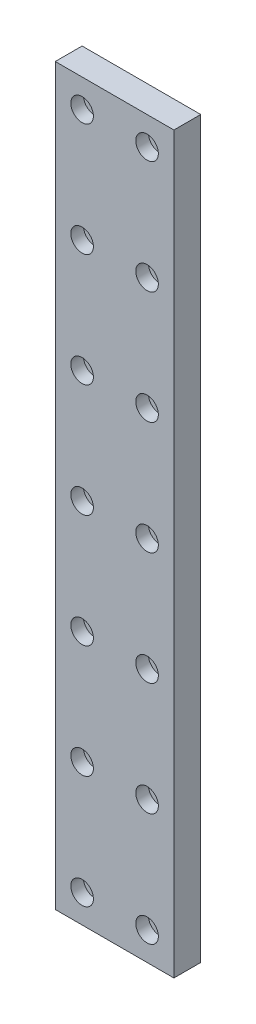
ISO-10303-21;
HEADER;
FILE_DESCRIPTION(('STEP AP214'),'2;1');
FILE_NAME('part.step','',(''),(''),'','','');
FILE_SCHEMA(('AUTOMOTIVE_DESIGN { 1 0 10303 214 1 1 1 1 }'));
ENDSEC;
DATA;
#1=APPLICATION_CONTEXT('core data for automotive mechanical design processes');
#2=APPLICATION_PROTOCOL_DEFINITION('international standard','automotive_design',2000,#1);
#3=PRODUCT_CONTEXT('',#1,'mechanical');
#4=PRODUCT('Part','Part','',(#3));
#5=PRODUCT_RELATED_PRODUCT_CATEGORY('part','',(#4));
#6=PRODUCT_DEFINITION_FORMATION('','',#4);
#7=PRODUCT_DEFINITION_CONTEXT('part definition',#1,'design');
#8=PRODUCT_DEFINITION('design','',#6,#7);
#9=PRODUCT_DEFINITION_SHAPE('','',#8);
#10=(LENGTH_UNIT() NAMED_UNIT(*) SI_UNIT(.MILLI.,.METRE.));
#11=(NAMED_UNIT(*) PLANE_ANGLE_UNIT() SI_UNIT($,.RADIAN.));
#12=(NAMED_UNIT(*) SI_UNIT($,.STERADIAN.) SOLID_ANGLE_UNIT());
#13=UNCERTAINTY_MEASURE_WITH_UNIT(LENGTH_MEASURE(1.E-05),#10,'distance_accuracy_value','');
#14=(GEOMETRIC_REPRESENTATION_CONTEXT(3) GLOBAL_UNCERTAINTY_ASSIGNED_CONTEXT((#13)) GLOBAL_UNIT_ASSIGNED_CONTEXT((#10,
#11,#12)) REPRESENTATION_CONTEXT('',''));
#15=CARTESIAN_POINT('',(0.,0.,0.));
#16=DIRECTION('',(0.,0.,1.));
#17=DIRECTION('',(1.,0.,0.));
#18=AXIS2_PLACEMENT_3D('',#15,#16,#17);
#19=CARTESIAN_POINT('',(-11.5,120.,0.));
#20=DIRECTION('',(0.,0.,1.));
#21=DIRECTION('',(1.,0.,0.));
#22=AXIS2_PLACEMENT_3D('',#19,#20,#21);
#23=CYLINDRICAL_SURFACE('',#22,2.25);
#24=CARTESIAN_POINT('',(-11.5,120.,0.));
#25=DIRECTION('',(0.,0.,1.));
#26=DIRECTION('',(1.,0.,0.));
#27=AXIS2_PLACEMENT_3D('',#24,#25,#26);
#28=CIRCLE('',#27,2.25);
#29=CARTESIAN_POINT('',(-9.25000000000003,120.,0.));
#30=VERTEX_POINT('',#29);
#31=EDGE_CURVE('E107',#30,#30,#28,.T.);
#32=ORIENTED_EDGE('',*,*,#31,.F.);
#33=EDGE_LOOP('',(#32));
#34=FACE_BOUND('',#33,.T.);
#35=CARTESIAN_POINT('',(-11.5,120.,5.));
#36=DIRECTION('',(0.,0.,1.));
#37=DIRECTION('',(1.,0.,0.));
#38=AXIS2_PLACEMENT_3D('',#35,#36,#37);
#39=CIRCLE('',#38,2.25);
#40=CARTESIAN_POINT('',(-9.25000000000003,120.,5.));
#41=VERTEX_POINT('',#40);
#42=EDGE_CURVE('E41',#41,#41,#39,.F.);
#43=ORIENTED_EDGE('',*,*,#42,.F.);
#44=EDGE_LOOP('',(#43));
#45=FACE_BOUND('',#44,.T.);
#46=ADVANCED_FACE('F37',(#34,#45),#23,.F.);
#47=CARTESIAN_POINT('',(-11.5000000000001,-120.,0.));
#48=DIRECTION('',(0.,0.,1.));
#49=DIRECTION('',(1.,0.,0.));
#50=AXIS2_PLACEMENT_3D('',#47,#48,#49);
#51=CYLINDRICAL_SURFACE('',#50,2.25);
#52=CARTESIAN_POINT('',(-11.5000000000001,-120.,0.));
#53=DIRECTION('',(0.,0.,1.));
#54=DIRECTION('',(1.,0.,0.));
#55=AXIS2_PLACEMENT_3D('',#52,#53,#54);
#56=CIRCLE('',#55,2.25);
#57=CARTESIAN_POINT('',(-9.25000000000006,-120.,0.));
#58=VERTEX_POINT('',#57);
#59=EDGE_CURVE('E158',#58,#58,#56,.T.);
#60=ORIENTED_EDGE('',*,*,#59,.F.);
#61=EDGE_LOOP('',(#60));
#62=FACE_BOUND('',#61,.T.);
#63=CARTESIAN_POINT('',(-11.5000000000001,-120.,5.));
#64=DIRECTION('',(0.,0.,1.));
#65=DIRECTION('',(1.,0.,0.));
#66=AXIS2_PLACEMENT_3D('',#63,#64,#65);
#67=CIRCLE('',#66,2.25);
#68=CARTESIAN_POINT('',(-9.25000000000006,-120.,5.));
#69=VERTEX_POINT('',#68);
#70=EDGE_CURVE('E149',#69,#69,#67,.F.);
#71=ORIENTED_EDGE('',*,*,#70,.F.);
#72=EDGE_LOOP('',(#71));
#73=FACE_BOUND('',#72,.T.);
#74=ADVANCED_FACE('F209',(#62,#73),#51,.F.);
#75=CARTESIAN_POINT('',(-11.5000000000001,-80.,0.));
#76=DIRECTION('',(0.,0.,1.));
#77=DIRECTION('',(1.,0.,0.));
#78=AXIS2_PLACEMENT_3D('',#75,#76,#77);
#79=CYLINDRICAL_SURFACE('',#78,2.25);
#80=CARTESIAN_POINT('',(-11.5000000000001,-80.,0.));
#81=DIRECTION('',(0.,0.,1.));
#82=DIRECTION('',(1.,0.,0.));
#83=AXIS2_PLACEMENT_3D('',#80,#81,#82);
#84=CIRCLE('',#83,2.25);
#85=CARTESIAN_POINT('',(-9.25000000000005,-80.,0.));
#86=VERTEX_POINT('',#85);
#87=EDGE_CURVE('E172',#86,#86,#84,.T.);
#88=ORIENTED_EDGE('',*,*,#87,.F.);
#89=EDGE_LOOP('',(#88));
#90=FACE_BOUND('',#89,.T.);
#91=CARTESIAN_POINT('',(-11.5000000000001,-80.,5.));
#92=DIRECTION('',(0.,0.,1.));
#93=DIRECTION('',(1.,0.,0.));
#94=AXIS2_PLACEMENT_3D('',#91,#92,#93);
#95=CIRCLE('',#94,2.25);
#96=CARTESIAN_POINT('',(-9.25000000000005,-80.,5.));
#97=VERTEX_POINT('',#96);
#98=EDGE_CURVE('E141',#97,#97,#95,.F.);
#99=ORIENTED_EDGE('',*,*,#98,.F.);
#100=EDGE_LOOP('',(#99));
#101=FACE_BOUND('',#100,.T.);
#102=ADVANCED_FACE('F214',(#90,#101),#79,.F.);
#103=CARTESIAN_POINT('',(-11.5000000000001,-40.,0.));
#104=DIRECTION('',(0.,0.,1.));
#105=DIRECTION('',(1.,0.,0.));
#106=AXIS2_PLACEMENT_3D('',#103,#104,#105);
#107=CYLINDRICAL_SURFACE('',#106,2.25);
#108=CARTESIAN_POINT('',(-11.5000000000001,-40.,0.));
#109=DIRECTION('',(0.,0.,1.));
#110=DIRECTION('',(1.,0.,0.));
#111=AXIS2_PLACEMENT_3D('',#108,#109,#110);
#112=CIRCLE('',#111,2.25);
#113=CARTESIAN_POINT('',(-9.25000000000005,-40.,0.));
#114=VERTEX_POINT('',#113);
#115=EDGE_CURVE('E196',#114,#114,#112,.T.);
#116=ORIENTED_EDGE('',*,*,#115,.F.);
#117=EDGE_LOOP('',(#116));
#118=FACE_BOUND('',#117,.T.);
#119=CARTESIAN_POINT('',(-11.5000000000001,-40.,5.));
#120=DIRECTION('',(0.,0.,1.));
#121=DIRECTION('',(1.,0.,0.));
#122=AXIS2_PLACEMENT_3D('',#119,#120,#121);
#123=CIRCLE('',#122,2.25);
#124=CARTESIAN_POINT('',(-9.25000000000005,-40.,5.));
#125=VERTEX_POINT('',#124);
#126=EDGE_CURVE('E132',#125,#125,#123,.F.);
#127=ORIENTED_EDGE('',*,*,#126,.F.);
#128=EDGE_LOOP('',(#127));
#129=FACE_BOUND('',#128,.T.);
#130=ADVANCED_FACE('F269',(#118,#129),#107,.F.);
#131=CARTESIAN_POINT('',(-11.5,0.,0.));
#132=DIRECTION('',(0.,0.,1.));
#133=DIRECTION('',(1.,0.,0.));
#134=AXIS2_PLACEMENT_3D('',#131,#132,#133);
#135=CYLINDRICAL_SURFACE('',#134,2.25);
#136=CARTESIAN_POINT('',(-11.5,0.,0.));
#137=DIRECTION('',(0.,0.,1.));
#138=DIRECTION('',(1.,0.,0.));
#139=AXIS2_PLACEMENT_3D('',#136,#137,#138);
#140=CIRCLE('',#139,2.25);
#141=CARTESIAN_POINT('',(-9.25000000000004,0.,0.));
#142=VERTEX_POINT('',#141);
#143=EDGE_CURVE('E190',#142,#142,#140,.T.);
#144=ORIENTED_EDGE('',*,*,#143,.F.);
#145=EDGE_LOOP('',(#144));
#146=FACE_BOUND('',#145,.T.);
#147=CARTESIAN_POINT('',(-11.5,0.,5.));
#148=DIRECTION('',(0.,0.,1.));
#149=DIRECTION('',(1.,0.,0.));
#150=AXIS2_PLACEMENT_3D('',#147,#148,#149);
#151=CIRCLE('',#150,2.25);
#152=CARTESIAN_POINT('',(-9.25000000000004,0.,5.));
#153=VERTEX_POINT('',#152);
#154=EDGE_CURVE('E126',#153,#153,#151,.F.);
#155=ORIENTED_EDGE('',*,*,#154,.F.);
#156=EDGE_LOOP('',(#155));
#157=FACE_BOUND('',#156,.T.);
#158=ADVANCED_FACE('F248',(#146,#157),#135,.F.);
#159=CARTESIAN_POINT('',(-11.5,40.,0.));
#160=DIRECTION('',(0.,0.,1.));
#161=DIRECTION('',(1.,0.,0.));
#162=AXIS2_PLACEMENT_3D('',#159,#160,#161);
#163=CYLINDRICAL_SURFACE('',#162,2.25);
#164=CARTESIAN_POINT('',(-11.5,40.,0.));
#165=DIRECTION('',(0.,0.,1.));
#166=DIRECTION('',(1.,0.,0.));
#167=AXIS2_PLACEMENT_3D('',#164,#165,#166);
#168=CIRCLE('',#167,2.25);
#169=CARTESIAN_POINT('',(-9.25000000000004,40.,0.));
#170=VERTEX_POINT('',#169);
#171=EDGE_CURVE('E184',#170,#170,#168,.T.);
#172=ORIENTED_EDGE('',*,*,#171,.F.);
#173=EDGE_LOOP('',(#172));
#174=FACE_BOUND('',#173,.T.);
#175=CARTESIAN_POINT('',(-11.5,40.,5.));
#176=DIRECTION('',(0.,0.,1.));
#177=DIRECTION('',(1.,0.,0.));
#178=AXIS2_PLACEMENT_3D('',#175,#176,#177);
#179=CIRCLE('',#178,2.25);
#180=CARTESIAN_POINT('',(-9.25000000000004,40.,5.));
#181=VERTEX_POINT('',#180);
#182=EDGE_CURVE('E120',#181,#181,#179,.F.);
#183=ORIENTED_EDGE('',*,*,#182,.F.);
#184=EDGE_LOOP('',(#183));
#185=FACE_BOUND('',#184,.T.);
#186=ADVANCED_FACE('F241',(#174,#185),#163,.F.);
#187=CARTESIAN_POINT('',(-11.5,80.,0.));
#188=DIRECTION('',(0.,0.,1.));
#189=DIRECTION('',(1.,0.,0.));
#190=AXIS2_PLACEMENT_3D('',#187,#188,#189);
#191=CYLINDRICAL_SURFACE('',#190,2.25);
#192=CARTESIAN_POINT('',(-11.5,80.,0.));
#193=DIRECTION('',(0.,0.,1.));
#194=DIRECTION('',(1.,0.,0.));
#195=AXIS2_PLACEMENT_3D('',#192,#193,#194);
#196=CIRCLE('',#195,2.25);
#197=CARTESIAN_POINT('',(-9.25000000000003,80.,0.));
#198=VERTEX_POINT('',#197);
#199=EDGE_CURVE('E178',#198,#198,#196,.T.);
#200=ORIENTED_EDGE('',*,*,#199,.F.);
#201=EDGE_LOOP('',(#200));
#202=FACE_BOUND('',#201,.T.);
#203=CARTESIAN_POINT('',(-11.5,80.,5.));
#204=DIRECTION('',(0.,0.,1.));
#205=DIRECTION('',(1.,0.,0.));
#206=AXIS2_PLACEMENT_3D('',#203,#204,#205);
#207=CIRCLE('',#206,2.25);
#208=CARTESIAN_POINT('',(-9.25000000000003,80.,5.));
#209=VERTEX_POINT('',#208);
#210=EDGE_CURVE('E113',#209,#209,#207,.F.);
#211=ORIENTED_EDGE('',*,*,#210,.F.);
#212=EDGE_LOOP('',(#211));
#213=FACE_BOUND('',#212,.T.);
#214=ADVANCED_FACE('F236',(#202,#213),#191,.F.);
#215=CARTESIAN_POINT('',(21.,130.,9.5));
#216=DIRECTION('',(-1.,0.,0.));
#217=DIRECTION('',(0.,-1.,0.));
#218=AXIS2_PLACEMENT_3D('',#215,#216,#217);
#219=PLANE('',#218);
#220=DIRECTION('',(0.,1.,0.));
#221=VECTOR('',#220,1.);
#222=CARTESIAN_POINT('',(21.,130.,0.));
#223=LINE('',#222,#221);
#224=CARTESIAN_POINT('',(21.,-130.,0.));
#225=VERTEX_POINT('',#224);
#226=CARTESIAN_POINT('',(21.,130.,0.));
#227=VERTEX_POINT('',#226);
#228=EDGE_CURVE('E104',#225,#227,#223,.T.);
#229=ORIENTED_EDGE('',*,*,#228,.T.);
#230=DIRECTION('',(0.,0.,-1.));
#231=VECTOR('',#230,1.);
#232=CARTESIAN_POINT('',(21.,130.,9.5));
#233=LINE('',#232,#231);
#234=CARTESIAN_POINT('',(21.,130.,9.5));
#235=VERTEX_POINT('',#234);
#236=EDGE_CURVE('E11',#235,#227,#233,.T.);
#237=ORIENTED_EDGE('',*,*,#236,.F.);
#238=DIRECTION('',(0.,1.,0.));
#239=VECTOR('',#238,1.);
#240=CARTESIAN_POINT('',(21.,130.,9.5));
#241=LINE('',#240,#239);
#242=CARTESIAN_POINT('',(21.,-130.,9.5));
#243=VERTEX_POINT('',#242);
#244=EDGE_CURVE('E91',#243,#235,#241,.T.);
#245=ORIENTED_EDGE('',*,*,#244,.F.);
#246=DIRECTION('',(0.,0.,-1.));
#247=VECTOR('',#246,1.);
#248=CARTESIAN_POINT('',(21.,-130.,9.5));
#249=LINE('',#248,#247);
#250=EDGE_CURVE('E100',#243,#225,#249,.T.);
#251=ORIENTED_EDGE('',*,*,#250,.T.);
#252=EDGE_LOOP('',(#229,#237,#245,#251));
#253=FACE_BOUND('',#252,.T.);
#254=ADVANCED_FACE('F39',(#253),#219,.F.);
#255=CARTESIAN_POINT('',(-21.,130.,9.5));
#256=DIRECTION('',(0.,-1.,0.));
#257=DIRECTION('',(0.,0.,-1.));
#258=AXIS2_PLACEMENT_3D('',#255,#256,#257);
#259=PLANE('',#258);
#260=DIRECTION('',(-1.,0.,0.));
#261=VECTOR('',#260,1.);
#262=CARTESIAN_POINT('',(-21.,130.,0.));
#263=LINE('',#262,#261);
#264=CARTESIAN_POINT('',(-21.,130.,0.));
#265=VERTEX_POINT('',#264);
#266=EDGE_CURVE('E95',#227,#265,#263,.T.);
#267=ORIENTED_EDGE('',*,*,#266,.T.);
#268=DIRECTION('',(0.,0.,-1.));
#269=VECTOR('',#268,1.);
#270=CARTESIAN_POINT('',(-21.,130.,9.5));
#271=LINE('',#270,#269);
#272=CARTESIAN_POINT('',(-21.,130.,9.5));
#273=VERTEX_POINT('',#272);
#274=EDGE_CURVE('E47',#273,#265,#271,.T.);
#275=ORIENTED_EDGE('',*,*,#274,.F.);
#276=DIRECTION('',(-1.,0.,0.));
#277=VECTOR('',#276,1.);
#278=CARTESIAN_POINT('',(-21.,130.,9.5));
#279=LINE('',#278,#277);
#280=EDGE_CURVE('E86',#235,#273,#279,.T.);
#281=ORIENTED_EDGE('',*,*,#280,.F.);
#282=ORIENTED_EDGE('',*,*,#236,.T.);
#283=EDGE_LOOP('',(#267,#275,#281,#282));
#284=FACE_BOUND('',#283,.T.);
#285=ADVANCED_FACE('F94',(#284),#259,.F.);
#286=CARTESIAN_POINT('',(-21.,130.,9.5));
#287=DIRECTION('',(1.,0.,0.));
#288=DIRECTION('',(0.,1.,0.));
#289=AXIS2_PLACEMENT_3D('',#286,#287,#288);
#290=PLANE('',#289);
#291=DIRECTION('',(0.,-1.,0.));
#292=VECTOR('',#291,1.);
#293=CARTESIAN_POINT('',(-21.,130.,0.));
#294=LINE('',#293,#292);
#295=CARTESIAN_POINT('',(-21.,-130.,0.));
#296=VERTEX_POINT('',#295);
#297=EDGE_CURVE('E73',#265,#296,#294,.T.);
#298=ORIENTED_EDGE('',*,*,#297,.T.);
#299=DIRECTION('',(0.,0.,-1.));
#300=VECTOR('',#299,1.);
#301=CARTESIAN_POINT('',(-21.,-130.,9.5));
#302=LINE('',#301,#300);
#303=CARTESIAN_POINT('',(-21.,-130.,9.5));
#304=VERTEX_POINT('',#303);
#305=EDGE_CURVE('E96',#304,#296,#302,.T.);
#306=ORIENTED_EDGE('',*,*,#305,.F.);
#307=DIRECTION('',(0.,-1.,0.));
#308=VECTOR('',#307,1.);
#309=CARTESIAN_POINT('',(-21.,130.,9.5));
#310=LINE('',#309,#308);
#311=EDGE_CURVE('E89',#273,#304,#310,.T.);
#312=ORIENTED_EDGE('',*,*,#311,.F.);
#313=ORIENTED_EDGE('',*,*,#274,.T.);
#314=EDGE_LOOP('',(#298,#306,#312,#313));
#315=FACE_BOUND('',#314,.T.);
#316=ADVANCED_FACE('F98',(#315),#290,.F.);
#317=CARTESIAN_POINT('',(-21.,-130.,9.5));
#318=DIRECTION('',(0.,1.,0.));
#319=DIRECTION('',(0.,0.,1.));
#320=AXIS2_PLACEMENT_3D('',#317,#318,#319);
#321=PLANE('',#320);
#322=DIRECTION('',(1.,0.,0.));
#323=VECTOR('',#322,1.);
#324=CARTESIAN_POINT('',(-21.,-130.,0.));
#325=LINE('',#324,#323);
#326=EDGE_CURVE('E79',#296,#225,#325,.T.);
#327=ORIENTED_EDGE('',*,*,#326,.T.);
#328=ORIENTED_EDGE('',*,*,#250,.F.);
#329=DIRECTION('',(1.,0.,0.));
#330=VECTOR('',#329,1.);
#331=CARTESIAN_POINT('',(-21.,-130.,9.5));
#332=LINE('',#331,#330);
#333=EDGE_CURVE('E56',#304,#243,#332,.T.);
#334=ORIENTED_EDGE('',*,*,#333,.F.);
#335=ORIENTED_EDGE('',*,*,#305,.T.);
#336=EDGE_LOOP('',(#327,#328,#334,#335));
#337=FACE_BOUND('',#336,.T.);
#338=ADVANCED_FACE('F223',(#337),#321,.F.);
#339=CARTESIAN_POINT('',(0.,0.,9.5));
#340=DIRECTION('',(0.,0.,1.));
#341=DIRECTION('',(1.,0.,0.));
#342=AXIS2_PLACEMENT_3D('',#339,#340,#341);
#343=PLANE('',#342);
#344=CARTESIAN_POINT('',(11.5,40.,9.5));
#345=DIRECTION('',(0.,0.,1.));
#346=DIRECTION('',(-1.,0.,0.));
#347=AXIS2_PLACEMENT_3D('',#344,#345,#346);
#348=CIRCLE('',#347,4.);
#349=CARTESIAN_POINT('',(7.50000000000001,40.,9.5));
#350=VERTEX_POINT('',#349);
#351=EDGE_CURVE('E857',#350,#350,#348,.T.);
#352=ORIENTED_EDGE('',*,*,#351,.F.);
#353=EDGE_LOOP('',(#352));
#354=FACE_BOUND('',#353,.T.);
#355=CARTESIAN_POINT('',(-11.5,0.,9.5));
#356=DIRECTION('',(0.,0.,1.));
#357=DIRECTION('',(1.,0.,0.));
#358=AXIS2_PLACEMENT_3D('',#355,#356,#357);
#359=CIRCLE('',#358,4.);
#360=CARTESIAN_POINT('',(-7.50000000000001,0.,9.5));
#361=VERTEX_POINT('',#360);
#362=EDGE_CURVE('E864',#361,#361,#359,.T.);
#363=ORIENTED_EDGE('',*,*,#362,.F.);
#364=EDGE_LOOP('',(#363));
#365=FACE_BOUND('',#364,.T.);
#366=CARTESIAN_POINT('',(11.5,0.,9.5));
#367=DIRECTION('',(0.,0.,1.));
#368=DIRECTION('',(-1.,0.,0.));
#369=AXIS2_PLACEMENT_3D('',#366,#367,#368);
#370=CIRCLE('',#369,4.);
#371=CARTESIAN_POINT('',(7.50000000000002,0.,9.5));
#372=VERTEX_POINT('',#371);
#373=EDGE_CURVE('E848',#372,#372,#370,.T.);
#374=ORIENTED_EDGE('',*,*,#373,.F.);
#375=EDGE_LOOP('',(#374));
#376=FACE_BOUND('',#375,.T.);
#377=CARTESIAN_POINT('',(-11.5,-40.,9.5));
#378=DIRECTION('',(0.,0.,1.));
#379=DIRECTION('',(1.,0.,0.));
#380=AXIS2_PLACEMENT_3D('',#377,#378,#379);
#381=CIRCLE('',#380,4.);
#382=CARTESIAN_POINT('',(-7.50000000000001,-40.,9.5));
#383=VERTEX_POINT('',#382);
#384=EDGE_CURVE('E853',#383,#383,#381,.T.);
#385=ORIENTED_EDGE('',*,*,#384,.F.);
#386=EDGE_LOOP('',(#385));
#387=FACE_BOUND('',#386,.T.);
#388=CARTESIAN_POINT('',(11.5,120.,9.5));
#389=DIRECTION('',(0.,0.,1.));
#390=DIRECTION('',(-1.,0.,0.));
#391=AXIS2_PLACEMENT_3D('',#388,#389,#390);
#392=CIRCLE('',#391,4.);
#393=CARTESIAN_POINT('',(7.5,120.,9.5));
#394=VERTEX_POINT('',#393);
#395=EDGE_CURVE('E881',#394,#394,#392,.T.);
#396=ORIENTED_EDGE('',*,*,#395,.F.);
#397=EDGE_LOOP('',(#396));
#398=FACE_BOUND('',#397,.T.);
#399=CARTESIAN_POINT('',(-11.5,80.,9.5));
#400=DIRECTION('',(0.,0.,1.));
#401=DIRECTION('',(1.,0.,0.));
#402=AXIS2_PLACEMENT_3D('',#399,#400,#401);
#403=CIRCLE('',#402,4.);
#404=CARTESIAN_POINT('',(-7.50000000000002,80.,9.5));
#405=VERTEX_POINT('',#404);
#406=EDGE_CURVE('E887',#405,#405,#403,.T.);
#407=ORIENTED_EDGE('',*,*,#406,.F.);
#408=EDGE_LOOP('',(#407));
#409=FACE_BOUND('',#408,.T.);
#410=CARTESIAN_POINT('',(11.5,80.,9.5));
#411=DIRECTION('',(0.,0.,1.));
#412=DIRECTION('',(-1.,0.,0.));
#413=AXIS2_PLACEMENT_3D('',#410,#411,#412);
#414=CIRCLE('',#413,4.);
#415=CARTESIAN_POINT('',(7.50000000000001,80.,9.5));
#416=VERTEX_POINT('',#415);
#417=EDGE_CURVE('E869',#416,#416,#414,.T.);
#418=ORIENTED_EDGE('',*,*,#417,.F.);
#419=EDGE_LOOP('',(#418));
#420=FACE_BOUND('',#419,.T.);
#421=CARTESIAN_POINT('',(-11.5,40.,9.5));
#422=DIRECTION('',(0.,0.,1.));
#423=DIRECTION('',(1.,0.,0.));
#424=AXIS2_PLACEMENT_3D('',#421,#422,#423);
#425=CIRCLE('',#424,4.);
#426=CARTESIAN_POINT('',(-7.50000000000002,40.,9.5));
#427=VERTEX_POINT('',#426);
#428=EDGE_CURVE('E876',#427,#427,#425,.T.);
#429=ORIENTED_EDGE('',*,*,#428,.F.);
#430=EDGE_LOOP('',(#429));
#431=FACE_BOUND('',#430,.T.);
#432=CARTESIAN_POINT('',(11.5,-120.,9.5));
#433=DIRECTION('',(0.,0.,1.));
#434=DIRECTION('',(-1.,0.,0.));
#435=AXIS2_PLACEMENT_3D('',#432,#433,#434);
#436=CIRCLE('',#435,4.);
#437=CARTESIAN_POINT('',(7.50000000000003,-120.,9.5));
#438=VERTEX_POINT('',#437);
#439=EDGE_CURVE('E819',#438,#438,#436,.T.);
#440=ORIENTED_EDGE('',*,*,#439,.F.);
#441=EDGE_LOOP('',(#440));
#442=FACE_BOUND('',#441,.T.);
#443=CARTESIAN_POINT('',(11.5,-40.,9.5));
#444=DIRECTION('',(0.,0.,1.));
#445=DIRECTION('',(-1.,0.,0.));
#446=AXIS2_PLACEMENT_3D('',#443,#444,#445);
#447=CIRCLE('',#446,4.);
#448=CARTESIAN_POINT('',(7.50000000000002,-40.,9.5));
#449=VERTEX_POINT('',#448);
#450=EDGE_CURVE('E836',#449,#449,#447,.T.);
#451=ORIENTED_EDGE('',*,*,#450,.F.);
#452=EDGE_LOOP('',(#451));
#453=FACE_BOUND('',#452,.T.);
#454=CARTESIAN_POINT('',(-11.5,-80.,9.5));
#455=DIRECTION('',(0.,0.,1.));
#456=DIRECTION('',(1.,0.,0.));
#457=AXIS2_PLACEMENT_3D('',#454,#455,#456);
#458=CIRCLE('',#457,4.);
#459=CARTESIAN_POINT('',(-7.5,-80.,9.5));
#460=VERTEX_POINT('',#459);
#461=EDGE_CURVE('E843',#460,#460,#458,.T.);
#462=ORIENTED_EDGE('',*,*,#461,.F.);
#463=EDGE_LOOP('',(#462));
#464=FACE_BOUND('',#463,.T.);
#465=CARTESIAN_POINT('',(11.5,-80.,9.5));
#466=DIRECTION('',(0.,0.,1.));
#467=DIRECTION('',(-1.,0.,0.));
#468=AXIS2_PLACEMENT_3D('',#465,#466,#467);
#469=CIRCLE('',#468,4.);
#470=CARTESIAN_POINT('',(7.50000000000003,-80.,9.5));
#471=VERTEX_POINT('',#470);
#472=EDGE_CURVE('E828',#471,#471,#469,.T.);
#473=ORIENTED_EDGE('',*,*,#472,.F.);
#474=EDGE_LOOP('',(#473));
#475=FACE_BOUND('',#474,.T.);
#476=CARTESIAN_POINT('',(-11.5,-120.,9.5));
#477=DIRECTION('',(0.,0.,1.));
#478=DIRECTION('',(1.,0.,0.));
#479=AXIS2_PLACEMENT_3D('',#476,#477,#478);
#480=CIRCLE('',#479,4.);
#481=CARTESIAN_POINT('',(-7.5,-120.,9.5));
#482=VERTEX_POINT('',#481);
#483=EDGE_CURVE('E824',#482,#482,#480,.T.);
#484=ORIENTED_EDGE('',*,*,#483,.F.);
#485=EDGE_LOOP('',(#484));
#486=FACE_BOUND('',#485,.T.);
#487=CARTESIAN_POINT('',(-11.5,120.,9.5));
#488=DIRECTION('',(0.,0.,1.));
#489=DIRECTION('',(1.,0.,0.));
#490=AXIS2_PLACEMENT_3D('',#487,#488,#489);
#491=CIRCLE('',#490,4.);
#492=CARTESIAN_POINT('',(-7.50000000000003,120.,9.5));
#493=VERTEX_POINT('',#492);
#494=EDGE_CURVE('E167',#493,#493,#491,.T.);
#495=ORIENTED_EDGE('',*,*,#494,.F.);
#496=EDGE_LOOP('',(#495));
#497=FACE_BOUND('',#496,.T.);
#498=ORIENTED_EDGE('',*,*,#244,.T.);
#499=ORIENTED_EDGE('',*,*,#280,.T.);
#500=ORIENTED_EDGE('',*,*,#311,.T.);
#501=ORIENTED_EDGE('',*,*,#333,.T.);
#502=EDGE_LOOP('',(#498,#499,#500,#501));
#503=FACE_BOUND('',#502,.T.);
#504=ADVANCED_FACE('F87',(#354,#365,#376,#387,#398,#409,#420,#431,#442,#453,#464,#475,#486,#497,
#503),#343,.T.);
#505=CARTESIAN_POINT('',(0.,0.,0.));
#506=DIRECTION('',(0.,0.,1.));
#507=DIRECTION('',(1.,0.,0.));
#508=AXIS2_PLACEMENT_3D('',#505,#506,#507);
#509=PLANE('',#508);
#510=ORIENTED_EDGE('',*,*,#199,.T.);
#511=EDGE_LOOP('',(#510));
#512=FACE_BOUND('',#511,.T.);
#513=CARTESIAN_POINT('',(11.5,80.,0.));
#514=DIRECTION('',(0.,0.,1.));
#515=DIRECTION('',(-1.,0.,0.));
#516=AXIS2_PLACEMENT_3D('',#513,#514,#515);
#517=CIRCLE('',#516,2.25);
#518=CARTESIAN_POINT('',(9.25,80.,0.));
#519=VERTEX_POINT('',#518);
#520=EDGE_CURVE('E181',#519,#519,#517,.T.);
#521=ORIENTED_EDGE('',*,*,#520,.T.);
#522=EDGE_LOOP('',(#521));
#523=FACE_BOUND('',#522,.T.);
#524=ORIENTED_EDGE('',*,*,#171,.T.);
#525=EDGE_LOOP('',(#524));
#526=FACE_BOUND('',#525,.T.);
#527=CARTESIAN_POINT('',(11.5,40.,0.));
#528=DIRECTION('',(0.,0.,1.));
#529=DIRECTION('',(-1.,0.,0.));
#530=AXIS2_PLACEMENT_3D('',#527,#528,#529);
#531=CIRCLE('',#530,2.25);
#532=CARTESIAN_POINT('',(9.24999999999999,40.,0.));
#533=VERTEX_POINT('',#532);
#534=EDGE_CURVE('E187',#533,#533,#531,.T.);
#535=ORIENTED_EDGE('',*,*,#534,.T.);
#536=EDGE_LOOP('',(#535));
#537=FACE_BOUND('',#536,.T.);
#538=ORIENTED_EDGE('',*,*,#143,.T.);
#539=EDGE_LOOP('',(#538));
#540=FACE_BOUND('',#539,.T.);
#541=CARTESIAN_POINT('',(11.5,0.,0.));
#542=DIRECTION('',(0.,0.,1.));
#543=DIRECTION('',(-1.,0.,0.));
#544=AXIS2_PLACEMENT_3D('',#541,#542,#543);
#545=CIRCLE('',#544,2.25);
#546=CARTESIAN_POINT('',(9.24999999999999,0.,0.));
#547=VERTEX_POINT('',#546);
#548=EDGE_CURVE('E193',#547,#547,#545,.T.);
#549=ORIENTED_EDGE('',*,*,#548,.T.);
#550=EDGE_LOOP('',(#549));
#551=FACE_BOUND('',#550,.T.);
#552=ORIENTED_EDGE('',*,*,#115,.T.);
#553=EDGE_LOOP('',(#552));
#554=FACE_BOUND('',#553,.T.);
#555=CARTESIAN_POINT('',(11.5,-40.,0.));
#556=DIRECTION('',(0.,0.,1.));
#557=DIRECTION('',(-1.,0.,0.));
#558=AXIS2_PLACEMENT_3D('',#555,#556,#557);
#559=CIRCLE('',#558,2.25);
#560=CARTESIAN_POINT('',(9.24999999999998,-40.,0.));
#561=VERTEX_POINT('',#560);
#562=EDGE_CURVE('E175',#561,#561,#559,.T.);
#563=ORIENTED_EDGE('',*,*,#562,.T.);
#564=EDGE_LOOP('',(#563));
#565=FACE_BOUND('',#564,.T.);
#566=CARTESIAN_POINT('',(11.5,-120.,0.));
#567=DIRECTION('',(0.,0.,1.));
#568=DIRECTION('',(-1.,0.,0.));
#569=AXIS2_PLACEMENT_3D('',#566,#567,#568);
#570=CIRCLE('',#569,2.25);
#571=CARTESIAN_POINT('',(9.24999999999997,-120.,0.));
#572=VERTEX_POINT('',#571);
#573=EDGE_CURVE('E154',#572,#572,#570,.T.);
#574=ORIENTED_EDGE('',*,*,#573,.T.);
#575=EDGE_LOOP('',(#574));
#576=FACE_BOUND('',#575,.T.);
#577=ORIENTED_EDGE('',*,*,#87,.T.);
#578=EDGE_LOOP('',(#577));
#579=FACE_BOUND('',#578,.T.);
#580=CARTESIAN_POINT('',(11.5,-80.,0.));
#581=DIRECTION('',(0.,0.,1.));
#582=DIRECTION('',(-1.,0.,0.));
#583=AXIS2_PLACEMENT_3D('',#580,#581,#582);
#584=CIRCLE('',#583,2.25);
#585=CARTESIAN_POINT('',(9.24999999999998,-80.,0.));
#586=VERTEX_POINT('',#585);
#587=EDGE_CURVE('E170',#586,#586,#584,.T.);
#588=ORIENTED_EDGE('',*,*,#587,.T.);
#589=EDGE_LOOP('',(#588));
#590=FACE_BOUND('',#589,.T.);
#591=CARTESIAN_POINT('',(11.5,120.,0.));
#592=DIRECTION('',(0.,0.,1.));
#593=DIRECTION('',(-1.,0.,0.));
#594=AXIS2_PLACEMENT_3D('',#591,#592,#593);
#595=CIRCLE('',#594,2.25);
#596=CARTESIAN_POINT('',(9.25000000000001,120.,0.));
#597=VERTEX_POINT('',#596);
#598=EDGE_CURVE('E163',#597,#597,#595,.T.);
#599=ORIENTED_EDGE('',*,*,#598,.T.);
#600=EDGE_LOOP('',(#599));
#601=FACE_BOUND('',#600,.T.);
#602=ORIENTED_EDGE('',*,*,#59,.T.);
#603=EDGE_LOOP('',(#602));
#604=FACE_BOUND('',#603,.T.);
#605=ORIENTED_EDGE('',*,*,#31,.T.);
#606=EDGE_LOOP('',(#605));
#607=FACE_BOUND('',#606,.T.);
#608=ORIENTED_EDGE('',*,*,#228,.F.);
#609=ORIENTED_EDGE('',*,*,#326,.F.);
#610=ORIENTED_EDGE('',*,*,#297,.F.);
#611=ORIENTED_EDGE('',*,*,#266,.F.);
#612=EDGE_LOOP('',(#608,#609,#610,#611));
#613=FACE_BOUND('',#612,.T.);
#614=ADVANCED_FACE('F204',(#512,#523,#526,#537,#540,#551,#554,#565,#576,#579,#590,#601,#604,
#607,#613),#509,.F.);
#615=CARTESIAN_POINT('',(11.5,120.,0.));
#616=DIRECTION('',(0.,0.,1.));
#617=DIRECTION('',(1.,0.,0.));
#618=AXIS2_PLACEMENT_3D('',#615,#616,#617);
#619=CYLINDRICAL_SURFACE('',#618,2.25);
#620=CARTESIAN_POINT('',(11.5,120.,5.));
#621=DIRECTION('',(0.,0.,-1.));
#622=DIRECTION('',(-1.,0.,0.));
#623=AXIS2_PLACEMENT_3D('',#620,#621,#622);
#624=CIRCLE('',#623,2.25);
#625=CARTESIAN_POINT('',(9.25000000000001,120.,5.));
#626=VERTEX_POINT('',#625);
#627=EDGE_CURVE('E147',#626,#626,#624,.F.);
#628=ORIENTED_EDGE('',*,*,#627,.T.);
#629=EDGE_LOOP('',(#628));
#630=FACE_BOUND('',#629,.T.);
#631=ORIENTED_EDGE('',*,*,#598,.F.);
#632=EDGE_LOOP('',(#631));
#633=FACE_BOUND('',#632,.T.);
#634=ADVANCED_FACE('F227',(#630,#633),#619,.F.);
#635=CARTESIAN_POINT('',(11.5,-80.,0.));
#636=DIRECTION('',(0.,0.,1.));
#637=DIRECTION('',(1.,0.,0.));
#638=AXIS2_PLACEMENT_3D('',#635,#636,#637);
#639=CYLINDRICAL_SURFACE('',#638,2.25);
#640=CARTESIAN_POINT('',(11.5,-80.,5.));
#641=DIRECTION('',(0.,0.,-1.));
#642=DIRECTION('',(-1.,0.,0.));
#643=AXIS2_PLACEMENT_3D('',#640,#641,#642);
#644=CIRCLE('',#643,2.25);
#645=CARTESIAN_POINT('',(9.24999999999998,-80.,5.));
#646=VERTEX_POINT('',#645);
#647=EDGE_CURVE('E144',#646,#646,#644,.F.);
#648=ORIENTED_EDGE('',*,*,#647,.T.);
#649=EDGE_LOOP('',(#648));
#650=FACE_BOUND('',#649,.T.);
#651=ORIENTED_EDGE('',*,*,#587,.F.);
#652=EDGE_LOOP('',(#651));
#653=FACE_BOUND('',#652,.T.);
#654=ADVANCED_FACE('F255',(#650,#653),#639,.F.);
#655=CARTESIAN_POINT('',(11.5,-120.,0.));
#656=DIRECTION('',(0.,0.,1.));
#657=DIRECTION('',(1.,0.,0.));
#658=AXIS2_PLACEMENT_3D('',#655,#656,#657);
#659=CYLINDRICAL_SURFACE('',#658,2.25);
#660=CARTESIAN_POINT('',(11.5,-120.,5.));
#661=DIRECTION('',(0.,0.,-1.));
#662=DIRECTION('',(-1.,0.,0.));
#663=AXIS2_PLACEMENT_3D('',#660,#661,#662);
#664=CIRCLE('',#663,2.25);
#665=CARTESIAN_POINT('',(9.24999999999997,-120.,5.));
#666=VERTEX_POINT('',#665);
#667=EDGE_CURVE('E138',#666,#666,#664,.F.);
#668=ORIENTED_EDGE('',*,*,#667,.T.);
#669=EDGE_LOOP('',(#668));
#670=FACE_BOUND('',#669,.T.);
#671=ORIENTED_EDGE('',*,*,#573,.F.);
#672=EDGE_LOOP('',(#671));
#673=FACE_BOUND('',#672,.T.);
#674=ADVANCED_FACE('F360',(#670,#673),#659,.F.);
#675=CARTESIAN_POINT('',(11.5,-40.,0.));
#676=DIRECTION('',(0.,0.,1.));
#677=DIRECTION('',(1.,0.,0.));
#678=AXIS2_PLACEMENT_3D('',#675,#676,#677);
#679=CYLINDRICAL_SURFACE('',#678,2.25);
#680=CARTESIAN_POINT('',(11.5,-40.,5.));
#681=DIRECTION('',(0.,0.,-1.));
#682=DIRECTION('',(-1.,0.,0.));
#683=AXIS2_PLACEMENT_3D('',#680,#681,#682);
#684=CIRCLE('',#683,2.25);
#685=CARTESIAN_POINT('',(9.24999999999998,-40.,5.));
#686=VERTEX_POINT('',#685);
#687=EDGE_CURVE('E135',#686,#686,#684,.F.);
#688=ORIENTED_EDGE('',*,*,#687,.T.);
#689=EDGE_LOOP('',(#688));
#690=FACE_BOUND('',#689,.T.);
#691=ORIENTED_EDGE('',*,*,#562,.F.);
#692=EDGE_LOOP('',(#691));
#693=FACE_BOUND('',#692,.T.);
#694=ADVANCED_FACE('F219',(#690,#693),#679,.F.);
#695=CARTESIAN_POINT('',(11.5,0.,0.));
#696=DIRECTION('',(0.,0.,1.));
#697=DIRECTION('',(1.,0.,0.));
#698=AXIS2_PLACEMENT_3D('',#695,#696,#697);
#699=CYLINDRICAL_SURFACE('',#698,2.25);
#700=CARTESIAN_POINT('',(11.5,0.,5.));
#701=DIRECTION('',(0.,0.,-1.));
#702=DIRECTION('',(-1.,0.,0.));
#703=AXIS2_PLACEMENT_3D('',#700,#701,#702);
#704=CIRCLE('',#703,2.25);
#705=CARTESIAN_POINT('',(9.24999999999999,0.,5.));
#706=VERTEX_POINT('',#705);
#707=EDGE_CURVE('E129',#706,#706,#704,.F.);
#708=ORIENTED_EDGE('',*,*,#707,.T.);
#709=EDGE_LOOP('',(#708));
#710=FACE_BOUND('',#709,.T.);
#711=ORIENTED_EDGE('',*,*,#548,.F.);
#712=EDGE_LOOP('',(#711));
#713=FACE_BOUND('',#712,.T.);
#714=ADVANCED_FACE('F265',(#710,#713),#699,.F.);
#715=CARTESIAN_POINT('',(11.5,40.,0.));
#716=DIRECTION('',(0.,0.,1.));
#717=DIRECTION('',(1.,0.,0.));
#718=AXIS2_PLACEMENT_3D('',#715,#716,#717);
#719=CYLINDRICAL_SURFACE('',#718,2.25);
#720=CARTESIAN_POINT('',(11.5,40.,5.));
#721=DIRECTION('',(0.,0.,-1.));
#722=DIRECTION('',(-1.,0.,0.));
#723=AXIS2_PLACEMENT_3D('',#720,#721,#722);
#724=CIRCLE('',#723,2.25);
#725=CARTESIAN_POINT('',(9.24999999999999,40.,5.));
#726=VERTEX_POINT('',#725);
#727=EDGE_CURVE('E123',#726,#726,#724,.F.);
#728=ORIENTED_EDGE('',*,*,#727,.T.);
#729=EDGE_LOOP('',(#728));
#730=FACE_BOUND('',#729,.T.);
#731=ORIENTED_EDGE('',*,*,#534,.F.);
#732=EDGE_LOOP('',(#731));
#733=FACE_BOUND('',#732,.T.);
#734=ADVANCED_FACE('F260',(#730,#733),#719,.F.);
#735=CARTESIAN_POINT('',(11.5,80.,0.));
#736=DIRECTION('',(0.,0.,1.));
#737=DIRECTION('',(1.,0.,0.));
#738=AXIS2_PLACEMENT_3D('',#735,#736,#737);
#739=CYLINDRICAL_SURFACE('',#738,2.25);
#740=CARTESIAN_POINT('',(11.5,80.,5.));
#741=DIRECTION('',(0.,0.,-1.));
#742=DIRECTION('',(-1.,0.,0.));
#743=AXIS2_PLACEMENT_3D('',#740,#741,#742);
#744=CIRCLE('',#743,2.25);
#745=CARTESIAN_POINT('',(9.25,80.,5.));
#746=VERTEX_POINT('',#745);
#747=EDGE_CURVE('E116',#746,#746,#744,.F.);
#748=ORIENTED_EDGE('',*,*,#747,.T.);
#749=EDGE_LOOP('',(#748));
#750=FACE_BOUND('',#749,.T.);
#751=ORIENTED_EDGE('',*,*,#520,.F.);
#752=EDGE_LOOP('',(#751));
#753=FACE_BOUND('',#752,.T.);
#754=ADVANCED_FACE('F257',(#750,#753),#739,.F.);
#755=CARTESIAN_POINT('',(-11.5,80.,5.));
#756=DIRECTION('',(0.,0.,1.));
#757=DIRECTION('',(1.,0.,0.));
#758=AXIS2_PLACEMENT_3D('',#755,#756,#757);
#759=PLANE('',#758);
#760=CARTESIAN_POINT('',(-11.5,80.,5.));
#761=DIRECTION('',(0.,0.,1.));
#762=DIRECTION('',(1.,0.,0.));
#763=AXIS2_PLACEMENT_3D('',#760,#761,#762);
#764=CIRCLE('',#763,4.);
#765=CARTESIAN_POINT('',(-7.50000000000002,80.,5.));
#766=VERTEX_POINT('',#765);
#767=EDGE_CURVE('E872',#766,#766,#764,.T.);
#768=ORIENTED_EDGE('',*,*,#767,.T.);
#769=EDGE_LOOP('',(#768));
#770=FACE_BOUND('',#769,.T.);
#771=ORIENTED_EDGE('',*,*,#210,.T.);
#772=EDGE_LOOP('',(#771));
#773=FACE_BOUND('',#772,.T.);
#774=ADVANCED_FACE('F259',(#770,#773),#759,.T.);
#775=CARTESIAN_POINT('',(-11.5,80.,5.));
#776=DIRECTION('',(0.,0.,1.));
#777=DIRECTION('',(1.,0.,0.));
#778=AXIS2_PLACEMENT_3D('',#775,#776,#777);
#779=CYLINDRICAL_SURFACE('',#778,4.);
#780=ORIENTED_EDGE('',*,*,#767,.F.);
#781=EDGE_LOOP('',(#780));
#782=FACE_BOUND('',#781,.T.);
#783=ORIENTED_EDGE('',*,*,#406,.T.);
#784=EDGE_LOOP('',(#783));
#785=FACE_BOUND('',#784,.T.);
#786=ADVANCED_FACE('F327',(#782,#785),#779,.F.);
#787=CARTESIAN_POINT('',(11.5,80.,5.));
#788=DIRECTION('',(0.,0.,-1.));
#789=DIRECTION('',(-1.,0.,0.));
#790=AXIS2_PLACEMENT_3D('',#787,#788,#789);
#791=PLANE('',#790);
#792=CARTESIAN_POINT('',(11.5,80.,5.));
#793=DIRECTION('',(0.,0.,1.));
#794=DIRECTION('',(-1.,0.,0.));
#795=AXIS2_PLACEMENT_3D('',#792,#793,#794);
#796=CIRCLE('',#795,4.);
#797=CARTESIAN_POINT('',(7.50000000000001,80.,5.));
#798=VERTEX_POINT('',#797);
#799=EDGE_CURVE('E873',#798,#798,#796,.T.);
#800=ORIENTED_EDGE('',*,*,#799,.T.);
#801=EDGE_LOOP('',(#800));
#802=FACE_BOUND('',#801,.T.);
#803=ORIENTED_EDGE('',*,*,#747,.F.);
#804=EDGE_LOOP('',(#803));
#805=FACE_BOUND('',#804,.T.);
#806=ADVANCED_FACE('F323',(#802,#805),#791,.F.);
#807=CARTESIAN_POINT('',(11.5,80.,5.));
#808=DIRECTION('',(0.,0.,1.));
#809=DIRECTION('',(1.,0.,0.));
#810=AXIS2_PLACEMENT_3D('',#807,#808,#809);
#811=CYLINDRICAL_SURFACE('',#810,4.);
#812=ORIENTED_EDGE('',*,*,#799,.F.);
#813=EDGE_LOOP('',(#812));
#814=FACE_BOUND('',#813,.T.);
#815=ORIENTED_EDGE('',*,*,#417,.T.);
#816=EDGE_LOOP('',(#815));
#817=FACE_BOUND('',#816,.T.);
#818=ADVANCED_FACE('F319',(#814,#817),#811,.F.);
#819=CARTESIAN_POINT('',(-11.5,40.,5.));
#820=DIRECTION('',(0.,0.,1.));
#821=DIRECTION('',(1.,0.,0.));
#822=AXIS2_PLACEMENT_3D('',#819,#820,#821);
#823=PLANE('',#822);
#824=CARTESIAN_POINT('',(-11.5,40.,5.));
#825=DIRECTION('',(0.,0.,1.));
#826=DIRECTION('',(1.,0.,0.));
#827=AXIS2_PLACEMENT_3D('',#824,#825,#826);
#828=CIRCLE('',#827,4.);
#829=CARTESIAN_POINT('',(-7.50000000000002,40.,5.));
#830=VERTEX_POINT('',#829);
#831=EDGE_CURVE('E860',#830,#830,#828,.T.);
#832=ORIENTED_EDGE('',*,*,#831,.T.);
#833=EDGE_LOOP('',(#832));
#834=FACE_BOUND('',#833,.T.);
#835=ORIENTED_EDGE('',*,*,#182,.T.);
#836=EDGE_LOOP('',(#835));
#837=FACE_BOUND('',#836,.T.);
#838=ADVANCED_FACE('F322',(#834,#837),#823,.T.);
#839=CARTESIAN_POINT('',(-11.5,40.,5.));
#840=DIRECTION('',(0.,0.,1.));
#841=DIRECTION('',(1.,0.,0.));
#842=AXIS2_PLACEMENT_3D('',#839,#840,#841);
#843=CYLINDRICAL_SURFACE('',#842,4.);
#844=ORIENTED_EDGE('',*,*,#831,.F.);
#845=EDGE_LOOP('',(#844));
#846=FACE_BOUND('',#845,.T.);
#847=ORIENTED_EDGE('',*,*,#428,.T.);
#848=EDGE_LOOP('',(#847));
#849=FACE_BOUND('',#848,.T.);
#850=ADVANCED_FACE('F310',(#846,#849),#843,.F.);
#851=CARTESIAN_POINT('',(11.5,40.,5.));
#852=DIRECTION('',(0.,0.,-1.));
#853=DIRECTION('',(-1.,0.,0.));
#854=AXIS2_PLACEMENT_3D('',#851,#852,#853);
#855=PLANE('',#854);
#856=CARTESIAN_POINT('',(11.5,40.,5.));
#857=DIRECTION('',(0.,0.,1.));
#858=DIRECTION('',(-1.,0.,0.));
#859=AXIS2_PLACEMENT_3D('',#856,#857,#858);
#860=CIRCLE('',#859,4.);
#861=CARTESIAN_POINT('',(7.50000000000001,40.,5.));
#862=VERTEX_POINT('',#861);
#863=EDGE_CURVE('E861',#862,#862,#860,.T.);
#864=ORIENTED_EDGE('',*,*,#863,.T.);
#865=EDGE_LOOP('',(#864));
#866=FACE_BOUND('',#865,.T.);
#867=ORIENTED_EDGE('',*,*,#727,.F.);
#868=EDGE_LOOP('',(#867));
#869=FACE_BOUND('',#868,.T.);
#870=ADVANCED_FACE('F306',(#866,#869),#855,.F.);
#871=CARTESIAN_POINT('',(11.5,40.,5.));
#872=DIRECTION('',(0.,0.,1.));
#873=DIRECTION('',(1.,0.,0.));
#874=AXIS2_PLACEMENT_3D('',#871,#872,#873);
#875=CYLINDRICAL_SURFACE('',#874,4.);
#876=ORIENTED_EDGE('',*,*,#863,.F.);
#877=EDGE_LOOP('',(#876));
#878=FACE_BOUND('',#877,.T.);
#879=ORIENTED_EDGE('',*,*,#351,.T.);
#880=EDGE_LOOP('',(#879));
#881=FACE_BOUND('',#880,.T.);
#882=ADVANCED_FACE('F302',(#878,#881),#875,.F.);
#883=CARTESIAN_POINT('',(-11.5,0.,5.));
#884=DIRECTION('',(0.,0.,1.));
#885=DIRECTION('',(1.,0.,0.));
#886=AXIS2_PLACEMENT_3D('',#883,#884,#885);
#887=PLANE('',#886);
#888=CARTESIAN_POINT('',(-11.5,0.,5.));
#889=DIRECTION('',(0.,0.,1.));
#890=DIRECTION('',(1.,0.,0.));
#891=AXIS2_PLACEMENT_3D('',#888,#889,#890);
#892=CIRCLE('',#891,4.);
#893=CARTESIAN_POINT('',(-7.50000000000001,0.,5.));
#894=VERTEX_POINT('',#893);
#895=EDGE_CURVE('E851',#894,#894,#892,.T.);
#896=ORIENTED_EDGE('',*,*,#895,.T.);
#897=EDGE_LOOP('',(#896));
#898=FACE_BOUND('',#897,.T.);
#899=ORIENTED_EDGE('',*,*,#154,.T.);
#900=EDGE_LOOP('',(#899));
#901=FACE_BOUND('',#900,.T.);
#902=ADVANCED_FACE('F305',(#898,#901),#887,.T.);
#903=CARTESIAN_POINT('',(-11.5,0.,5.));
#904=DIRECTION('',(0.,0.,1.));
#905=DIRECTION('',(1.,0.,0.));
#906=AXIS2_PLACEMENT_3D('',#903,#904,#905);
#907=CYLINDRICAL_SURFACE('',#906,4.);
#908=ORIENTED_EDGE('',*,*,#895,.F.);
#909=EDGE_LOOP('',(#908));
#910=FACE_BOUND('',#909,.T.);
#911=ORIENTED_EDGE('',*,*,#362,.T.);
#912=EDGE_LOOP('',(#911));
#913=FACE_BOUND('',#912,.T.);
#914=ADVANCED_FACE('F312',(#910,#913),#907,.F.);
#915=CARTESIAN_POINT('',(11.5,0.,5.));
#916=DIRECTION('',(0.,0.,-1.));
#917=DIRECTION('',(-1.,0.,0.));
#918=AXIS2_PLACEMENT_3D('',#915,#916,#917);
#919=PLANE('',#918);
#920=CARTESIAN_POINT('',(11.5,0.,5.));
#921=DIRECTION('',(0.,0.,1.));
#922=DIRECTION('',(-1.,0.,0.));
#923=AXIS2_PLACEMENT_3D('',#920,#921,#922);
#924=CIRCLE('',#923,4.);
#925=CARTESIAN_POINT('',(7.50000000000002,0.,5.));
#926=VERTEX_POINT('',#925);
#927=EDGE_CURVE('E426',#926,#926,#924,.T.);
#928=ORIENTED_EDGE('',*,*,#927,.T.);
#929=EDGE_LOOP('',(#928));
#930=FACE_BOUND('',#929,.T.);
#931=ORIENTED_EDGE('',*,*,#707,.F.);
#932=EDGE_LOOP('',(#931));
#933=FACE_BOUND('',#932,.T.);
#934=ADVANCED_FACE('F296',(#930,#933),#919,.F.);
#935=CARTESIAN_POINT('',(11.5,0.,5.));
#936=DIRECTION('',(0.,0.,1.));
#937=DIRECTION('',(1.,0.,0.));
#938=AXIS2_PLACEMENT_3D('',#935,#936,#937);
#939=CYLINDRICAL_SURFACE('',#938,4.);
#940=ORIENTED_EDGE('',*,*,#927,.F.);
#941=EDGE_LOOP('',(#940));
#942=FACE_BOUND('',#941,.T.);
#943=ORIENTED_EDGE('',*,*,#373,.T.);
#944=EDGE_LOOP('',(#943));
#945=FACE_BOUND('',#944,.T.);
#946=ADVANCED_FACE('F286',(#942,#945),#939,.F.);
#947=CARTESIAN_POINT('',(-11.5,-40.,5.));
#948=DIRECTION('',(0.,0.,1.));
#949=DIRECTION('',(1.,0.,0.));
#950=AXIS2_PLACEMENT_3D('',#947,#948,#949);
#951=PLANE('',#950);
#952=CARTESIAN_POINT('',(-11.5,-40.,5.));
#953=DIRECTION('',(0.,0.,1.));
#954=DIRECTION('',(1.,0.,0.));
#955=AXIS2_PLACEMENT_3D('',#952,#953,#954);
#956=CIRCLE('',#955,4.);
#957=CARTESIAN_POINT('',(-7.50000000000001,-40.,5.));
#958=VERTEX_POINT('',#957);
#959=EDGE_CURVE('E839',#958,#958,#956,.T.);
#960=ORIENTED_EDGE('',*,*,#959,.T.);
#961=EDGE_LOOP('',(#960));
#962=FACE_BOUND('',#961,.T.);
#963=ORIENTED_EDGE('',*,*,#126,.T.);
#964=EDGE_LOOP('',(#963));
#965=FACE_BOUND('',#964,.T.);
#966=ADVANCED_FACE('F283',(#962,#965),#951,.T.);
#967=CARTESIAN_POINT('',(-11.5,-40.,5.));
#968=DIRECTION('',(0.,0.,1.));
#969=DIRECTION('',(1.,0.,0.));
#970=AXIS2_PLACEMENT_3D('',#967,#968,#969);
#971=CYLINDRICAL_SURFACE('',#970,4.);
#972=ORIENTED_EDGE('',*,*,#959,.F.);
#973=EDGE_LOOP('',(#972));
#974=FACE_BOUND('',#973,.T.);
#975=ORIENTED_EDGE('',*,*,#384,.T.);
#976=EDGE_LOOP('',(#975));
#977=FACE_BOUND('',#976,.T.);
#978=ADVANCED_FACE('F285',(#974,#977),#971,.F.);
#979=CARTESIAN_POINT('',(11.5,-40.,5.));
#980=DIRECTION('',(0.,0.,-1.));
#981=DIRECTION('',(-1.,0.,0.));
#982=AXIS2_PLACEMENT_3D('',#979,#980,#981);
#983=PLANE('',#982);
#984=CARTESIAN_POINT('',(11.5,-40.,5.));
#985=DIRECTION('',(0.,0.,1.));
#986=DIRECTION('',(-1.,0.,0.));
#987=AXIS2_PLACEMENT_3D('',#984,#985,#986);
#988=CIRCLE('',#987,4.);
#989=CARTESIAN_POINT('',(7.50000000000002,-40.,5.));
#990=VERTEX_POINT('',#989);
#991=EDGE_CURVE('E840',#990,#990,#988,.T.);
#992=ORIENTED_EDGE('',*,*,#991,.T.);
#993=EDGE_LOOP('',(#992));
#994=FACE_BOUND('',#993,.T.);
#995=ORIENTED_EDGE('',*,*,#687,.F.);
#996=EDGE_LOOP('',(#995));
#997=FACE_BOUND('',#996,.T.);
#998=ADVANCED_FACE('F293',(#994,#997),#983,.F.);
#999=CARTESIAN_POINT('',(11.5,-40.,5.));
#1000=DIRECTION('',(0.,0.,1.));
#1001=DIRECTION('',(1.,0.,0.));
#1002=AXIS2_PLACEMENT_3D('',#999,#1000,#1001);
#1003=CYLINDRICAL_SURFACE('',#1002,4.);
#1004=ORIENTED_EDGE('',*,*,#991,.F.);
#1005=EDGE_LOOP('',(#1004));
#1006=FACE_BOUND('',#1005,.T.);
#1007=ORIENTED_EDGE('',*,*,#450,.T.);
#1008=EDGE_LOOP('',(#1007));
#1009=FACE_BOUND('',#1008,.T.);
#1010=ADVANCED_FACE('F408',(#1006,#1009),#1003,.F.);
#1011=CARTESIAN_POINT('',(11.5,-120.,5.));
#1012=DIRECTION('',(0.,0.,-1.));
#1013=DIRECTION('',(-1.,0.,0.));
#1014=AXIS2_PLACEMENT_3D('',#1011,#1012,#1013);
#1015=PLANE('',#1014);
#1016=CARTESIAN_POINT('',(11.5,-120.,5.));
#1017=DIRECTION('',(0.,0.,1.));
#1018=DIRECTION('',(-1.,0.,0.));
#1019=AXIS2_PLACEMENT_3D('',#1016,#1017,#1018);
#1020=CIRCLE('',#1019,4.);
#1021=CARTESIAN_POINT('',(7.50000000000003,-120.,5.));
#1022=VERTEX_POINT('',#1021);
#1023=EDGE_CURVE('E816',#1022,#1022,#1020,.T.);
#1024=ORIENTED_EDGE('',*,*,#1023,.T.);
#1025=EDGE_LOOP('',(#1024));
#1026=FACE_BOUND('',#1025,.T.);
#1027=ORIENTED_EDGE('',*,*,#667,.F.);
#1028=EDGE_LOOP('',(#1027));
#1029=FACE_BOUND('',#1028,.T.);
#1030=ADVANCED_FACE('F411',(#1026,#1029),#1015,.F.);
#1031=CARTESIAN_POINT('',(11.5,-120.,5.));
#1032=DIRECTION('',(0.,0.,1.));
#1033=DIRECTION('',(1.,0.,0.));
#1034=AXIS2_PLACEMENT_3D('',#1031,#1032,#1033);
#1035=CYLINDRICAL_SURFACE('',#1034,4.);
#1036=ORIENTED_EDGE('',*,*,#1023,.F.);
#1037=EDGE_LOOP('',(#1036));
#1038=FACE_BOUND('',#1037,.T.);
#1039=ORIENTED_EDGE('',*,*,#439,.T.);
#1040=EDGE_LOOP('',(#1039));
#1041=FACE_BOUND('',#1040,.T.);
#1042=ADVANCED_FACE('F417',(#1038,#1041),#1035,.F.);
#1043=CARTESIAN_POINT('',(-11.5,-80.,5.));
#1044=DIRECTION('',(0.,0.,1.));
#1045=DIRECTION('',(1.,0.,0.));
#1046=AXIS2_PLACEMENT_3D('',#1043,#1044,#1045);
#1047=PLANE('',#1046);
#1048=CARTESIAN_POINT('',(-11.5,-80.,5.));
#1049=DIRECTION('',(0.,0.,1.));
#1050=DIRECTION('',(1.,0.,0.));
#1051=AXIS2_PLACEMENT_3D('',#1048,#1049,#1050);
#1052=CIRCLE('',#1051,4.);
#1053=CARTESIAN_POINT('',(-7.5,-80.,5.));
#1054=VERTEX_POINT('',#1053);
#1055=EDGE_CURVE('E831',#1054,#1054,#1052,.T.);
#1056=ORIENTED_EDGE('',*,*,#1055,.T.);
#1057=EDGE_LOOP('',(#1056));
#1058=FACE_BOUND('',#1057,.T.);
#1059=ORIENTED_EDGE('',*,*,#98,.T.);
#1060=EDGE_LOOP('',(#1059));
#1061=FACE_BOUND('',#1060,.T.);
#1062=ADVANCED_FACE('F396',(#1058,#1061),#1047,.T.);
#1063=CARTESIAN_POINT('',(-11.5,-80.,5.));
#1064=DIRECTION('',(0.,0.,1.));
#1065=DIRECTION('',(1.,0.,0.));
#1066=AXIS2_PLACEMENT_3D('',#1063,#1064,#1065);
#1067=CYLINDRICAL_SURFACE('',#1066,4.);
#1068=ORIENTED_EDGE('',*,*,#1055,.F.);
#1069=EDGE_LOOP('',(#1068));
#1070=FACE_BOUND('',#1069,.T.);
#1071=ORIENTED_EDGE('',*,*,#461,.T.);
#1072=EDGE_LOOP('',(#1071));
#1073=FACE_BOUND('',#1072,.T.);
#1074=ADVANCED_FACE('F387',(#1070,#1073),#1067,.F.);
#1075=CARTESIAN_POINT('',(11.5,-80.,5.));
#1076=DIRECTION('',(0.,0.,-1.));
#1077=DIRECTION('',(-1.,0.,0.));
#1078=AXIS2_PLACEMENT_3D('',#1075,#1076,#1077);
#1079=PLANE('',#1078);
#1080=CARTESIAN_POINT('',(11.5,-80.,5.));
#1081=DIRECTION('',(0.,0.,1.));
#1082=DIRECTION('',(-1.,0.,0.));
#1083=AXIS2_PLACEMENT_3D('',#1080,#1081,#1082);
#1084=CIRCLE('',#1083,4.);
#1085=CARTESIAN_POINT('',(7.50000000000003,-80.,5.));
#1086=VERTEX_POINT('',#1085);
#1087=EDGE_CURVE('E832',#1086,#1086,#1084,.T.);
#1088=ORIENTED_EDGE('',*,*,#1087,.T.);
#1089=EDGE_LOOP('',(#1088));
#1090=FACE_BOUND('',#1089,.T.);
#1091=ORIENTED_EDGE('',*,*,#647,.F.);
#1092=EDGE_LOOP('',(#1091));
#1093=FACE_BOUND('',#1092,.T.);
#1094=ADVANCED_FACE('F385',(#1090,#1093),#1079,.F.);
#1095=CARTESIAN_POINT('',(11.5,-80.,5.));
#1096=DIRECTION('',(0.,0.,1.));
#1097=DIRECTION('',(1.,0.,0.));
#1098=AXIS2_PLACEMENT_3D('',#1095,#1096,#1097);
#1099=CYLINDRICAL_SURFACE('',#1098,4.);
#1100=ORIENTED_EDGE('',*,*,#1087,.F.);
#1101=EDGE_LOOP('',(#1100));
#1102=FACE_BOUND('',#1101,.T.);
#1103=ORIENTED_EDGE('',*,*,#472,.T.);
#1104=EDGE_LOOP('',(#1103));
#1105=FACE_BOUND('',#1104,.T.);
#1106=ADVANCED_FACE('F343',(#1102,#1105),#1099,.F.);
#1107=CARTESIAN_POINT('',(11.5,120.,5.));
#1108=DIRECTION('',(0.,0.,-1.));
#1109=DIRECTION('',(-1.,0.,0.));
#1110=AXIS2_PLACEMENT_3D('',#1107,#1108,#1109);
#1111=PLANE('',#1110);
#1112=CARTESIAN_POINT('',(11.5,120.,5.));
#1113=DIRECTION('',(0.,0.,1.));
#1114=DIRECTION('',(-1.,0.,0.));
#1115=AXIS2_PLACEMENT_3D('',#1112,#1113,#1114);
#1116=CIRCLE('',#1115,4.);
#1117=CARTESIAN_POINT('',(7.5,120.,5.));
#1118=VERTEX_POINT('',#1117);
#1119=EDGE_CURVE('E884',#1118,#1118,#1116,.T.);
#1120=ORIENTED_EDGE('',*,*,#1119,.T.);
#1121=EDGE_LOOP('',(#1120));
#1122=FACE_BOUND('',#1121,.T.);
#1123=ORIENTED_EDGE('',*,*,#627,.F.);
#1124=EDGE_LOOP('',(#1123));
#1125=FACE_BOUND('',#1124,.T.);
#1126=ADVANCED_FACE('F339',(#1122,#1125),#1111,.F.);
#1127=CARTESIAN_POINT('',(11.5,120.,5.));
#1128=DIRECTION('',(0.,0.,1.));
#1129=DIRECTION('',(1.,0.,0.));
#1130=AXIS2_PLACEMENT_3D('',#1127,#1128,#1129);
#1131=CYLINDRICAL_SURFACE('',#1130,4.);
#1132=ORIENTED_EDGE('',*,*,#1119,.F.);
#1133=EDGE_LOOP('',(#1132));
#1134=FACE_BOUND('',#1133,.T.);
#1135=ORIENTED_EDGE('',*,*,#395,.T.);
#1136=EDGE_LOOP('',(#1135));
#1137=FACE_BOUND('',#1136,.T.);
#1138=ADVANCED_FACE('F335',(#1134,#1137),#1131,.F.);
#1139=CARTESIAN_POINT('',(-11.5,-120.,5.));
#1140=DIRECTION('',(0.,0.,1.));
#1141=DIRECTION('',(1.,0.,0.));
#1142=AXIS2_PLACEMENT_3D('',#1139,#1140,#1141);
#1143=PLANE('',#1142);
#1144=CARTESIAN_POINT('',(-11.5,-120.,5.));
#1145=DIRECTION('',(0.,0.,1.));
#1146=DIRECTION('',(1.,0.,0.));
#1147=AXIS2_PLACEMENT_3D('',#1144,#1145,#1146);
#1148=CIRCLE('',#1147,4.);
#1149=CARTESIAN_POINT('',(-7.5,-120.,5.));
#1150=VERTEX_POINT('',#1149);
#1151=EDGE_CURVE('E821',#1150,#1150,#1148,.T.);
#1152=ORIENTED_EDGE('',*,*,#1151,.T.);
#1153=EDGE_LOOP('',(#1152));
#1154=FACE_BOUND('',#1153,.T.);
#1155=ORIENTED_EDGE('',*,*,#70,.T.);
#1156=EDGE_LOOP('',(#1155));
#1157=FACE_BOUND('',#1156,.T.);
#1158=ADVANCED_FACE('F338',(#1154,#1157),#1143,.T.);
#1159=CARTESIAN_POINT('',(-11.5,-120.,5.));
#1160=DIRECTION('',(0.,0.,1.));
#1161=DIRECTION('',(1.,0.,0.));
#1162=AXIS2_PLACEMENT_3D('',#1159,#1160,#1161);
#1163=CYLINDRICAL_SURFACE('',#1162,4.);
#1164=ORIENTED_EDGE('',*,*,#1151,.F.);
#1165=EDGE_LOOP('',(#1164));
#1166=FACE_BOUND('',#1165,.T.);
#1167=ORIENTED_EDGE('',*,*,#483,.T.);
#1168=EDGE_LOOP('',(#1167));
#1169=FACE_BOUND('',#1168,.T.);
#1170=ADVANCED_FACE('F355',(#1166,#1169),#1163,.F.);
#1171=CARTESIAN_POINT('',(-11.5,120.,5.));
#1172=DIRECTION('',(0.,0.,1.));
#1173=DIRECTION('',(1.,0.,0.));
#1174=AXIS2_PLACEMENT_3D('',#1171,#1172,#1173);
#1175=PLANE('',#1174);
#1176=CARTESIAN_POINT('',(-11.5,120.,5.));
#1177=DIRECTION('',(0.,0.,1.));
#1178=DIRECTION('',(1.,0.,0.));
#1179=AXIS2_PLACEMENT_3D('',#1176,#1177,#1178);
#1180=CIRCLE('',#1179,4.);
#1181=CARTESIAN_POINT('',(-7.50000000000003,120.,5.));
#1182=VERTEX_POINT('',#1181);
#1183=EDGE_CURVE('E117',#1182,#1182,#1180,.T.);
#1184=ORIENTED_EDGE('',*,*,#1183,.T.);
#1185=EDGE_LOOP('',(#1184));
#1186=FACE_BOUND('',#1185,.T.);
#1187=ORIENTED_EDGE('',*,*,#42,.T.);
#1188=EDGE_LOOP('',(#1187));
#1189=FACE_BOUND('',#1188,.T.);
#1190=ADVANCED_FACE('F351',(#1186,#1189),#1175,.T.);
#1191=CARTESIAN_POINT('',(-11.5,120.,5.));
#1192=DIRECTION('',(0.,0.,1.));
#1193=DIRECTION('',(1.,0.,0.));
#1194=AXIS2_PLACEMENT_3D('',#1191,#1192,#1193);
#1195=CYLINDRICAL_SURFACE('',#1194,4.);
#1196=ORIENTED_EDGE('',*,*,#1183,.F.);
#1197=EDGE_LOOP('',(#1196));
#1198=FACE_BOUND('',#1197,.T.);
#1199=ORIENTED_EDGE('',*,*,#494,.T.);
#1200=EDGE_LOOP('',(#1199));
#1201=FACE_BOUND('',#1200,.T.);
#1202=ADVANCED_FACE('F354',(#1198,#1201),#1195,.F.);
#1203=CLOSED_SHELL('',(#46,#74,#102,#130,#158,#186,#214,#254,#285,#316,#338,#504,#614,#634,#654,
#674,#694,#714,#734,#754,#774,#786,#806,#818,#838,#850,#870,#882,#902,#914,#934,#946,#966,#978,
#998,#1010,#1030,#1042,#1062,#1074,#1094,#1106,#1126,#1138,#1158,#1170,#1190,#1202));
#1204=MANIFOLD_SOLID_BREP('B2',#1203);
#1205=ADVANCED_BREP_SHAPE_REPRESENTATION('',(#18,#1204),#14);
#1206=SHAPE_DEFINITION_REPRESENTATION(#9,#1205);
ENDSEC;
END-ISO-10303-21;
